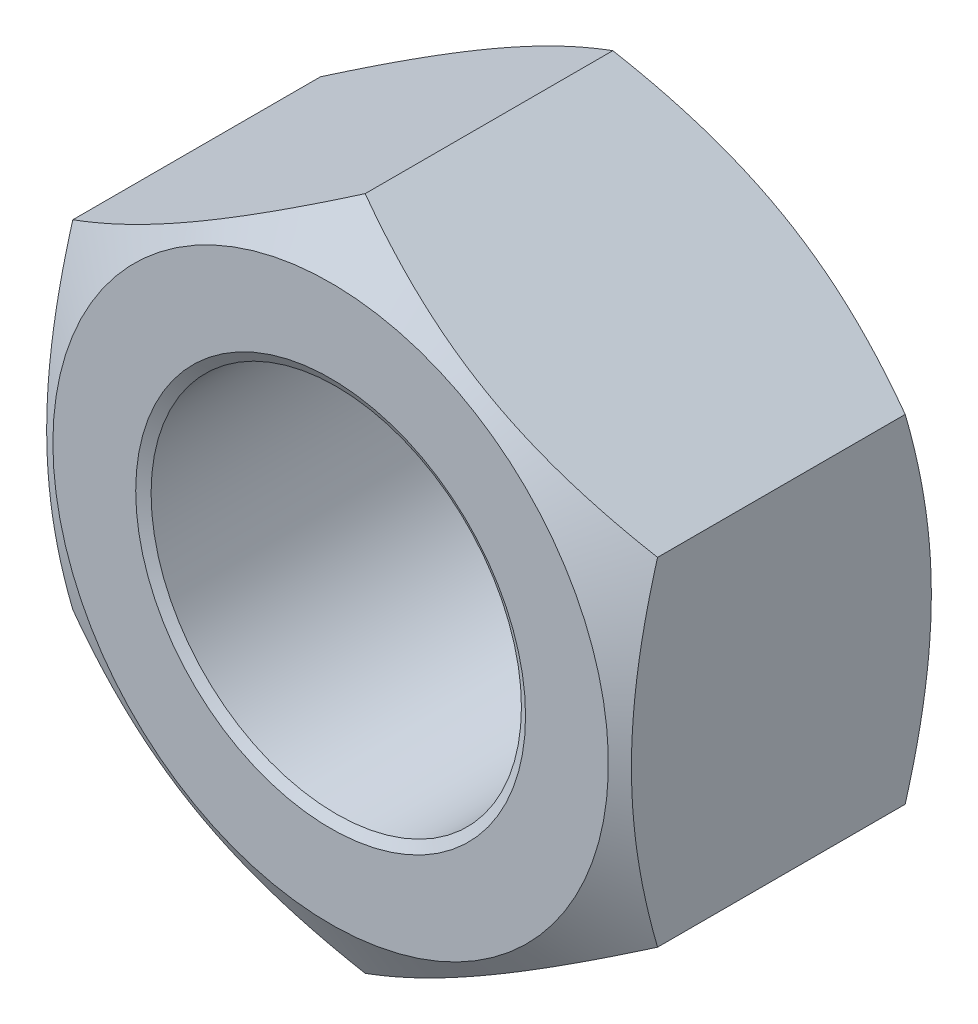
ISO-10303-21;
HEADER;
FILE_DESCRIPTION(('STEP AP214'),'2;1');
FILE_NAME('part.step','',(''),(''),'','','');
FILE_SCHEMA(('AUTOMOTIVE_DESIGN { 1 0 10303 214 1 1 1 1 }'));
ENDSEC;
DATA;
#1=APPLICATION_CONTEXT('core data for automotive mechanical design processes');
#2=APPLICATION_PROTOCOL_DEFINITION('international standard','automotive_design',2000,#1);
#3=PRODUCT_CONTEXT('',#1,'mechanical');
#4=PRODUCT('Part','Part','',(#3));
#5=PRODUCT_RELATED_PRODUCT_CATEGORY('part','',(#4));
#6=PRODUCT_DEFINITION_FORMATION('','',#4);
#7=PRODUCT_DEFINITION_CONTEXT('part definition',#1,'design');
#8=PRODUCT_DEFINITION('design','',#6,#7);
#9=PRODUCT_DEFINITION_SHAPE('','',#8);
#10=(LENGTH_UNIT() NAMED_UNIT(*) SI_UNIT(.MILLI.,.METRE.));
#11=(NAMED_UNIT(*) PLANE_ANGLE_UNIT() SI_UNIT($,.RADIAN.));
#12=(NAMED_UNIT(*) SI_UNIT($,.STERADIAN.) SOLID_ANGLE_UNIT());
#13=UNCERTAINTY_MEASURE_WITH_UNIT(LENGTH_MEASURE(1.E-05),#10,'distance_accuracy_value','');
#14=(GEOMETRIC_REPRESENTATION_CONTEXT(3) GLOBAL_UNCERTAINTY_ASSIGNED_CONTEXT((#13)) GLOBAL_UNIT_ASSIGNED_CONTEXT((#10,
#11,#12)) REPRESENTATION_CONTEXT('',''));
#15=CARTESIAN_POINT('',(0.,0.,0.));
#16=DIRECTION('',(0.,0.,1.));
#17=DIRECTION('',(1.,0.,0.));
#18=AXIS2_PLACEMENT_3D('',#15,#16,#17);
#19=CARTESIAN_POINT('',(0.,13.856406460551,13.));
#20=DIRECTION('',(-0.499999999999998,-0.86602540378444,0.));
#21=DIRECTION('',(0.86602540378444,-0.499999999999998,0.));
#22=AXIS2_PLACEMENT_3D('',#19,#20,#21);
#23=PLANE('',#22);
#24=DIRECTION('',(0.,0.,-1.));
#25=VECTOR('',#24,1.);
#26=CARTESIAN_POINT('',(12.,6.92820323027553,13.));
#27=LINE('',#26,#25);
#28=CARTESIAN_POINT('',(12.,6.92820323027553,11.5817930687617));
#29=VERTEX_POINT('',#28);
#30=CARTESIAN_POINT('',(12.,6.92820323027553,1.41820693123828));
#31=VERTEX_POINT('',#30);
#32=EDGE_CURVE('E232',#29,#31,#27,.T.);
#33=ORIENTED_EDGE('',*,*,#32,.T.);
#34=CARTESIAN_POINT('',(12.0002,6.9280877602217,1.41827359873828));
#35=CARTESIAN_POINT('',(11.7364142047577,7.08038456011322,1.33035979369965));
#36=CARTESIAN_POINT('',(11.4716448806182,7.23324920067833,1.24643615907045));
#37=CARTESIAN_POINT('',(10.9399829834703,7.54020434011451,1.08767638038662));
#38=CARTESIAN_POINT('',(10.6730897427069,7.69429522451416,1.01284322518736));
#39=CARTESIAN_POINT('',(9.86810959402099,8.15905073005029,0.803427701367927));
#40=CARTESIAN_POINT('',(9.32684492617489,8.47155003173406,0.684313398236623));
#41=CARTESIAN_POINT('',(8.51686717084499,8.93919090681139,0.544641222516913));
#42=CARTESIAN_POINT('',(8.25057389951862,9.09293539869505,0.504853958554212));
#43=CARTESIAN_POINT('',(7.71675440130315,9.40113622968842,0.438133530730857));
#44=CARTESIAN_POINT('',(7.44922815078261,9.55559258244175,0.411200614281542));
#45=CARTESIAN_POINT('',(6.91372963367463,9.86476279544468,0.370878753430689));
#46=CARTESIAN_POINT('',(6.64575827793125,10.0194761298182,0.357473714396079));
#47=CARTESIAN_POINT('',(6.10956726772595,10.3290461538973,0.344493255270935));
#48=CARTESIAN_POINT('',(5.84134762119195,10.4839028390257,0.344917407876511));
#49=CARTESIAN_POINT('',(5.33991062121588,10.7734076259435,0.358630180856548));
#50=CARTESIAN_POINT('',(5.10665750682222,10.908076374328,0.370246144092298));
#51=CARTESIAN_POINT('',(4.6406877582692,11.1771041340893,0.40371817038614));
#52=CARTESIAN_POINT('',(4.4079711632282,11.3114631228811,0.425574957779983));
#53=CARTESIAN_POINT('',(3.94320092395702,11.5797983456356,0.479147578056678));
#54=CARTESIAN_POINT('',(3.71114798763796,11.7137741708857,0.510871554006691));
#55=CARTESIAN_POINT('',(3.24813003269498,11.9810977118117,0.583621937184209));
#56=CARTESIAN_POINT('',(3.01716508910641,12.1144453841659,0.624648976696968));
#57=CARTESIAN_POINT('',(2.31605804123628,12.5192297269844,0.762721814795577));
#58=CARTESIAN_POINT('',(1.84794625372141,12.789494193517,0.8735350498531));
#59=CARTESIAN_POINT('',(0.918702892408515,13.3259930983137,1.12503592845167));
#60=CARTESIAN_POINT('',(0.457559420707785,13.5922344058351,1.26566450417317));
#61=CARTESIAN_POINT('',(-0.000200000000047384,13.8565219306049,1.41827359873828));
#62=B_SPLINE_CURVE_WITH_KNOTS('',3,(#34,#35,#36,#37,#38,#39,#40,#41,#42,#43,#44,#45,#46,#47,#48,
#49,#50,#51,#52,#53,#54,#55,#56,#57,#58,#59,#60,#61),.UNSPECIFIED.,.F.,.F.,(4,2,2,2,2,2,2,2,2,2,
2,2,2,4),(0.,0.951004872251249,1.90232158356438,3.80900466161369,4.73894551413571,
5.6689042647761,6.59775529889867,7.52657763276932,8.33514643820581,9.14377244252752,
9.95306755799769,10.7624176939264,12.4167102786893,14.0677556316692),.UNSPECIFIED.);
#63=CARTESIAN_POINT('',(0.,13.856406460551,1.41820693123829));
#64=VERTEX_POINT('',#63);
#65=EDGE_CURVE('E51',#31,#64,#62,.T.);
#66=ORIENTED_EDGE('',*,*,#65,.T.);
#67=DIRECTION('',(0.,0.,-1.));
#68=VECTOR('',#67,1.);
#69=CARTESIAN_POINT('',(0.,13.856406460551,13.));
#70=LINE('',#69,#68);
#71=CARTESIAN_POINT('',(0.,13.856406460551,11.5817930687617));
#72=VERTEX_POINT('',#71);
#73=EDGE_CURVE('E105',#72,#64,#70,.T.);
#74=ORIENTED_EDGE('',*,*,#73,.F.);
#75=CARTESIAN_POINT('',(-0.000200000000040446,13.8565219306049,11.5817264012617));
#76=CARTESIAN_POINT('',(0.263585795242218,13.7042251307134,11.6696402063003));
#77=CARTESIAN_POINT('',(0.528355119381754,13.5513604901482,11.7535638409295));
#78=CARTESIAN_POINT('',(1.06001701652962,13.244405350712,11.9123236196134));
#79=CARTESIAN_POINT('',(1.32691025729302,13.0903144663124,11.9871567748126));
#80=CARTESIAN_POINT('',(2.13189040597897,12.6255589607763,12.196572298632));
#81=CARTESIAN_POINT('',(2.67315507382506,12.3130596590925,12.3156866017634));
#82=CARTESIAN_POINT('',(3.48313282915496,11.8454187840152,12.4553587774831));
#83=CARTESIAN_POINT('',(3.74942610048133,11.6916742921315,12.4951460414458));
#84=CARTESIAN_POINT('',(4.2832455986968,11.3834734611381,12.5618664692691));
#85=CARTESIAN_POINT('',(4.55077184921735,11.2290171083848,12.5887993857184));
#86=CARTESIAN_POINT('',(5.08627036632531,10.9198468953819,12.6291212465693));
#87=CARTESIAN_POINT('',(5.35424172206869,10.7651335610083,12.6425262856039));
#88=CARTESIAN_POINT('',(5.89043273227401,10.4555635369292,12.655506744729));
#89=CARTESIAN_POINT('',(6.15865237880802,10.3007068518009,12.6550825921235));
#90=CARTESIAN_POINT('',(6.66008937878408,10.0112020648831,12.6413698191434));
#91=CARTESIAN_POINT('',(6.89334249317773,9.87653331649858,12.6297538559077));
#92=CARTESIAN_POINT('',(7.35931224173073,9.60750555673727,12.5962818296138));
#93=CARTESIAN_POINT('',(7.59202883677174,9.47314656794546,12.57442504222));
#94=CARTESIAN_POINT('',(8.05679907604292,9.20481134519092,12.5208524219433));
#95=CARTESIAN_POINT('',(8.28885201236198,9.07083551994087,12.4891284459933));
#96=CARTESIAN_POINT('',(8.75186996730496,8.80351197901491,12.4163780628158));
#97=CARTESIAN_POINT('',(8.98283491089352,8.67016430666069,12.375351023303));
#98=CARTESIAN_POINT('',(9.68394195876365,8.26537996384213,12.2372781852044));
#99=CARTESIAN_POINT('',(10.1520537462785,7.99511549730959,12.1264649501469));
#100=CARTESIAN_POINT('',(11.0812971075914,7.45861659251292,11.8749640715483));
#101=CARTESIAN_POINT('',(11.5424405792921,7.19237528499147,11.7343354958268));
#102=CARTESIAN_POINT('',(12.0002,6.92808776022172,11.5817264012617));
#103=B_SPLINE_CURVE_WITH_KNOTS('',3,(#75,#76,#77,#78,#79,#80,#81,#82,#83,#84,#85,#86,#87,#88,
#89,#90,#91,#92,#93,#94,#95,#96,#97,#98,#99,#100,#101,#102),.UNSPECIFIED.,.F.,.F.,(4,2,2,2,2,2,
2,2,2,2,2,2,2,4),(0.,0.951004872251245,1.90232158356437,3.80900466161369,4.73894551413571,
5.6689042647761,6.59775529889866,7.52657763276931,8.33514643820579,9.1437724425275,
9.95306755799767,10.7624176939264,12.4167102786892,14.0677556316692),.UNSPECIFIED.);
#104=EDGE_CURVE('E149',#72,#29,#103,.T.);
#105=ORIENTED_EDGE('',*,*,#104,.T.);
#106=EDGE_LOOP('',(#33,#66,#74,#105));
#107=FACE_BOUND('',#106,.T.);
#108=ADVANCED_FACE('F36',(#107),#23,.F.);
#109=CARTESIAN_POINT('',(-12.,6.92820323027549,13.));
#110=DIRECTION('',(0.500000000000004,-0.866025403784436,0.));
#111=DIRECTION('',(0.866025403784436,0.500000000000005,0.));
#112=AXIS2_PLACEMENT_3D('',#109,#110,#111);
#113=PLANE('',#112);
#114=ORIENTED_EDGE('',*,*,#73,.T.);
#115=CARTESIAN_POINT('',(0.000199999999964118,13.8565219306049,1.41827359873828));
#116=CARTESIAN_POINT('',(-0.263585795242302,13.7042251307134,1.33035979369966));
#117=CARTESIAN_POINT('',(-0.528355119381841,13.5513604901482,1.24643615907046));
#118=CARTESIAN_POINT('',(-1.0600170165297,13.2444053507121,1.08767638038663));
#119=CARTESIAN_POINT('',(-1.32691025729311,13.0903144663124,1.01284322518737));
#120=CARTESIAN_POINT('',(-2.13189040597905,12.6255589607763,0.803427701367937));
#121=CARTESIAN_POINT('',(-2.67315507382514,12.3130596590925,0.684313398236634));
#122=CARTESIAN_POINT('',(-3.48313282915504,11.8454187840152,0.544641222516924));
#123=CARTESIAN_POINT('',(-3.74942610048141,11.6916742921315,0.504853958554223));
#124=CARTESIAN_POINT('',(-4.28324559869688,11.3834734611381,0.438133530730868));
#125=CARTESIAN_POINT('',(-4.55077184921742,11.2290171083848,0.411200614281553));
#126=CARTESIAN_POINT('',(-5.08627036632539,10.9198468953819,0.370878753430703));
#127=CARTESIAN_POINT('',(-5.35424172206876,10.7651335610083,0.357473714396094));
#128=CARTESIAN_POINT('',(-5.89043273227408,10.4555635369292,0.344493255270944));
#129=CARTESIAN_POINT('',(-6.15865237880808,10.3007068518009,0.344917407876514));
#130=CARTESIAN_POINT('',(-6.66008937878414,10.011202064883,0.358630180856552));
#131=CARTESIAN_POINT('',(-6.89334249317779,9.87653331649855,0.370246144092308));
#132=CARTESIAN_POINT('',(-7.3593122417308,9.60750555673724,0.403718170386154));
#133=CARTESIAN_POINT('',(-7.5920288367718,9.47314656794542,0.425574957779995));
#134=CARTESIAN_POINT('',(-8.05679907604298,9.20481134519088,0.479147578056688));
#135=CARTESIAN_POINT('',(-8.28885201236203,9.07083551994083,0.510871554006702));
#136=CARTESIAN_POINT('',(-8.75186996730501,8.80351197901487,0.583621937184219));
#137=CARTESIAN_POINT('',(-8.98283491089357,8.67016430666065,0.624648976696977));
#138=CARTESIAN_POINT('',(-9.68394195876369,8.26537996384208,0.762721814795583));
#139=CARTESIAN_POINT('',(-10.1520537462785,7.99511549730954,0.873535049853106));
#140=CARTESIAN_POINT('',(-11.0812971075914,7.45861659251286,1.12503592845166));
#141=CARTESIAN_POINT('',(-11.5424405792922,7.1923752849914,1.26566450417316));
#142=CARTESIAN_POINT('',(-12.0002,6.92808776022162,1.41827359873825));
#143=B_SPLINE_CURVE_WITH_KNOTS('',3,(#115,#116,#117,#118,#119,#120,#121,#122,#123,#124,#125,
#126,#127,#128,#129,#130,#131,#132,#133,#134,#135,#136,#137,#138,#139,#140,#141,#142),
.UNSPECIFIED.,.F.,.F.,(4,2,2,2,2,2,2,2,2,2,2,2,2,4),(0.,0.95100487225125,1.90232158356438,
3.8090046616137,4.73894551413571,5.66890426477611,6.59775529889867,7.52657763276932,
8.3351464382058,9.14377244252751,9.95306755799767,10.7624176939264,12.4167102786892,
14.0677556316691),.UNSPECIFIED.);
#144=CARTESIAN_POINT('',(-12.,6.92820323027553,1.41820693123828));
#145=VERTEX_POINT('',#144);
#146=EDGE_CURVE('E90',#64,#145,#143,.T.);
#147=ORIENTED_EDGE('',*,*,#146,.T.);
#148=DIRECTION('',(0.,0.,-1.));
#149=VECTOR('',#148,1.);
#150=CARTESIAN_POINT('',(-12.,6.92820323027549,13.));
#151=LINE('',#150,#149);
#152=CARTESIAN_POINT('',(-12.,6.92820323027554,11.5817930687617));
#153=VERTEX_POINT('',#152);
#154=EDGE_CURVE('E103',#153,#145,#151,.T.);
#155=ORIENTED_EDGE('',*,*,#154,.F.);
#156=CARTESIAN_POINT('',(-12.0002,6.92808776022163,11.5817264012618));
#157=CARTESIAN_POINT('',(-11.7364142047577,7.08038456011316,11.6696402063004));
#158=CARTESIAN_POINT('',(-11.4716448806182,7.23324920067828,11.7535638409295));
#159=CARTESIAN_POINT('',(-10.9399829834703,7.54020434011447,11.9123236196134));
#160=CARTESIAN_POINT('',(-10.6730897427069,7.69429522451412,11.9871567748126));
#161=CARTESIAN_POINT('',(-9.868109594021,8.15905073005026,12.1965722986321));
#162=CARTESIAN_POINT('',(-9.32684492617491,8.47155003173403,12.3156866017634));
#163=CARTESIAN_POINT('',(-8.51686717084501,8.93919090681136,12.4553587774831));
#164=CARTESIAN_POINT('',(-8.25057389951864,9.09293539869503,12.4951460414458));
#165=CARTESIAN_POINT('',(-7.71675440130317,9.40113622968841,12.5618664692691));
#166=CARTESIAN_POINT('',(-7.44922815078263,9.55559258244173,12.5887993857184));
#167=CARTESIAN_POINT('',(-6.91372963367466,9.86476279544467,12.6291212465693));
#168=CARTESIAN_POINT('',(-6.64575827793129,10.0194761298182,12.6425262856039));
#169=CARTESIAN_POINT('',(-6.10956726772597,10.3290461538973,12.655506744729));
#170=CARTESIAN_POINT('',(-5.84134762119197,10.4839028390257,12.6550825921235));
#171=CARTESIAN_POINT('',(-5.33991062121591,10.7734076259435,12.6413698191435));
#172=CARTESIAN_POINT('',(-5.10665750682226,10.908076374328,12.6297538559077));
#173=CARTESIAN_POINT('',(-4.64068775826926,11.1771041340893,12.5962818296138));
#174=CARTESIAN_POINT('',(-4.40797116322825,11.3114631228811,12.57442504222));
#175=CARTESIAN_POINT('',(-3.94320092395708,11.5797983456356,12.5208524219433));
#176=CARTESIAN_POINT('',(-3.71114798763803,11.7137741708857,12.4891284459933));
#177=CARTESIAN_POINT('',(-3.24813003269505,11.9810977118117,12.4163780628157));
#178=CARTESIAN_POINT('',(-3.01716508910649,12.1144453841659,12.375351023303));
#179=CARTESIAN_POINT('',(-2.31605804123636,12.5192297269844,12.2372781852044));
#180=CARTESIAN_POINT('',(-1.8479462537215,12.789494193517,12.1264649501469));
#181=CARTESIAN_POINT('',(-0.918702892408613,13.3259930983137,11.8749640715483));
#182=CARTESIAN_POINT('',(-0.457559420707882,13.5922344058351,11.7343354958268));
#183=CARTESIAN_POINT('',(0.000199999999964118,13.8565219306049,11.5817264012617));
#184=B_SPLINE_CURVE_WITH_KNOTS('',3,(#156,#157,#158,#159,#160,#161,#162,#163,#164,#165,#166,
#167,#168,#169,#170,#171,#172,#173,#174,#175,#176,#177,#178,#179,#180,#181,#182,#183),
.UNSPECIFIED.,.F.,.F.,(4,2,2,2,2,2,2,2,2,2,2,2,2,4),(0.,0.951004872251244,1.90232158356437,
3.80900466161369,4.7389455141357,5.6689042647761,6.59775529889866,7.52657763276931,
8.33514643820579,9.14377244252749,9.95306755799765,10.7624176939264,12.4167102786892,
14.0677556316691),.UNSPECIFIED.);
#185=EDGE_CURVE('E220',#153,#72,#184,.T.);
#186=ORIENTED_EDGE('',*,*,#185,.T.);
#187=EDGE_LOOP('',(#114,#147,#155,#186));
#188=FACE_BOUND('',#187,.T.);
#189=ADVANCED_FACE('F101',(#188),#113,.F.);
#190=CARTESIAN_POINT('',(-12.,6.92820323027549,13.));
#191=DIRECTION('',(1.,0.,0.));
#192=DIRECTION('',(0.,1.,0.));
#193=AXIS2_PLACEMENT_3D('',#190,#191,#192);
#194=PLANE('',#193);
#195=ORIENTED_EDGE('',*,*,#154,.T.);
#196=CARTESIAN_POINT('',(-12.,-18.3266119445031,6.06553478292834));
#197=CARTESIAN_POINT('',(-12.,-18.0633738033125,5.93838905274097));
#198=CARTESIAN_POINT('',(-12.,-17.7998161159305,5.81190522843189));
#199=CARTESIAN_POINT('',(-12.,-17.2719941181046,5.56041343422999));
#200=CARTESIAN_POINT('',(-12.,-17.0077297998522,5.43540548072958));
#201=CARTESIAN_POINT('',(-12.,-16.2136974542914,5.06278691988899));
#202=CARTESIAN_POINT('',(-12.,-15.6827764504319,4.81762347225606));
#203=CARTESIAN_POINT('',(-12.,-14.6141865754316,4.33400167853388));
#204=CARTESIAN_POINT('',(-12.,-14.0764964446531,4.09559018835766));
#205=CARTESIAN_POINT('',(-12.,-12.9966796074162,3.62907285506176));
#206=CARTESIAN_POINT('',(-12.,-12.4545531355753,3.40096647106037));
#207=CARTESIAN_POINT('',(-12.,-11.3584956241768,2.95519182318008));
#208=CARTESIAN_POINT('',(-12.,-10.804500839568,2.73767946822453));
#209=CARTESIAN_POINT('',(-12.,-9.68995596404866,2.31980973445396));
#210=CARTESIAN_POINT('',(-12.,-9.12940515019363,2.11945426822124));
#211=CARTESIAN_POINT('',(-12.,-8.00204242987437,1.74131954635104));
#212=CARTESIAN_POINT('',(-12.,-7.4352468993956,1.56349187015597));
#213=CARTESIAN_POINT('',(-12.,-6.29354549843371,1.23621050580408));
#214=CARTESIAN_POINT('',(-12.,-5.71864226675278,1.08674780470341));
#215=CARTESIAN_POINT('',(-12.,-4.85009397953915,0.889319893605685));
#216=CARTESIAN_POINT('',(-12.,-4.55947337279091,0.827959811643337));
#217=CARTESIAN_POINT('',(-12.,-3.97630768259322,0.715136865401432));
#218=CARTESIAN_POINT('',(-12.,-3.68376264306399,0.663673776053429));
#219=CARTESIAN_POINT('',(-12.,-3.09694252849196,0.571559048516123));
#220=CARTESIAN_POINT('',(-12.,-2.80266731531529,0.530908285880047));
#221=CARTESIAN_POINT('',(-12.,-2.21274417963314,0.461238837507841));
#222=CARTESIAN_POINT('',(-12.,-1.91709630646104,0.4322197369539));
#223=CARTESIAN_POINT('',(-12.,-1.32669155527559,0.386589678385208));
#224=CARTESIAN_POINT('',(-12.,-1.03194060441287,0.369902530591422));
#225=CARTESIAN_POINT('',(-12.,-0.441998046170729,0.349024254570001));
#226=CARTESIAN_POINT('',(-12.,-0.146806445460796,0.344832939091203));
#227=CARTESIAN_POINT('',(-12.,0.443406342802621,0.34904547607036));
#228=CARTESIAN_POINT('',(-12.,0.738427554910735,0.357445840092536));
#229=CARTESIAN_POINT('',(-12.,1.32786031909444,0.386634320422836));
#230=CARTESIAN_POINT('',(-12.,1.62227183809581,0.407423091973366));
#231=CARTESIAN_POINT('',(-12.,2.33716550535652,0.472512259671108));
#232=CARTESIAN_POINT('',(-12.,2.7570868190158,0.523093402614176));
#233=CARTESIAN_POINT('',(-12.,3.59360745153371,0.646630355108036));
#234=CARTESIAN_POINT('',(-12.,4.01020626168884,0.719589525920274));
#235=CARTESIAN_POINT('',(-12.,5.25576165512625,0.968370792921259));
#236=CARTESIAN_POINT('',(-12.,6.07884579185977,1.17392928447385));
#237=CARTESIAN_POINT('',(-12.,7.30994810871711,1.52797009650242));
#238=CARTESIAN_POINT('',(-12.,7.72440857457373,1.65531708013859));
#239=CARTESIAN_POINT('',(-12.,8.54932524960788,1.92260619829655));
#240=CARTESIAN_POINT('',(-12.,8.95978109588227,2.06254946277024));
#241=CARTESIAN_POINT('',(-12.,9.77464090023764,2.35205699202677));
#242=CARTESIAN_POINT('',(-12.,10.1790659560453,2.50156237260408));
#243=CARTESIAN_POINT('',(-12.,10.7831621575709,2.7322434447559));
#244=CARTESIAN_POINT('',(-12.,10.9840717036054,2.81019450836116));
#245=CARTESIAN_POINT('',(-12.,11.3851122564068,2.96806360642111));
#246=CARTESIAN_POINT('',(-12.,11.5852432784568,3.04798160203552));
#247=CARTESIAN_POINT('',(-12.,11.7850121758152,3.12879414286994));
#248=B_SPLINE_CURVE_WITH_KNOTS('',3,(#196,#197,#198,#199,#200,#201,#202,#203,#204,#205,#206,
#207,#208,#209,#210,#211,#212,#213,#214,#215,#216,#217,#218,#219,#220,#221,#222,#223,#224,#225,
#226,#227,#228,#229,#230,#231,#232,#233,#234,#235,#236,#237,#238,#239,#240,#241,#242,#243,#244,
#245,#246,#247),.UNSPECIFIED.,.F.,.F.,(4,2,2,2,2,2,2,2,2,2,2,2,2,2,2,2,2,2,2,2,2,2,2,2,2,4),(0.,
0.877006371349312,1.75402247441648,3.50834272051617,5.2727863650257,7.03713729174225,
8.8224164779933,10.6078944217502,12.3894671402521,14.1704728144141,15.0614141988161,
15.9523353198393,16.8433285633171,17.7342900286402,18.6196998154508,19.5050963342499,
20.3902476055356,21.2754456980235,22.5435942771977,23.8119334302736,26.3535098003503,
27.6541599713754,28.9549269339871,30.248337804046,30.8948341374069,31.5413177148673),.UNSPECIFIED.);
#249=CARTESIAN_POINT('',(-12.,-6.92820323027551,1.41820693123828));
#250=VERTEX_POINT('',#249);
#251=EDGE_CURVE('E87',#145,#250,#248,.F.);
#252=ORIENTED_EDGE('',*,*,#251,.T.);
#253=DIRECTION('',(0.,0.,-1.));
#254=VECTOR('',#253,1.);
#255=CARTESIAN_POINT('',(-12.,-6.92820323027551,13.));
#256=LINE('',#255,#254);
#257=CARTESIAN_POINT('',(-12.,-6.92820323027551,11.5817930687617));
#258=VERTEX_POINT('',#257);
#259=EDGE_CURVE('E110',#258,#250,#256,.T.);
#260=ORIENTED_EDGE('',*,*,#259,.F.);
#261=CARTESIAN_POINT('',(-12.,-18.3266119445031,6.93446521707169));
#262=CARTESIAN_POINT('',(-12.,-18.0633738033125,7.06161094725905));
#263=CARTESIAN_POINT('',(-12.,-17.7998161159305,7.18809477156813));
#264=CARTESIAN_POINT('',(-12.,-17.2719941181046,7.43958656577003));
#265=CARTESIAN_POINT('',(-12.,-17.0077297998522,7.56459451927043));
#266=CARTESIAN_POINT('',(-12.,-16.2136974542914,7.93721308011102));
#267=CARTESIAN_POINT('',(-12.,-15.6827764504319,8.18237652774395));
#268=CARTESIAN_POINT('',(-12.,-14.6141865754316,8.66599832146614));
#269=CARTESIAN_POINT('',(-12.,-14.0764964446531,8.90440981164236));
#270=CARTESIAN_POINT('',(-12.,-12.9966796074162,9.37092714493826));
#271=CARTESIAN_POINT('',(-12.,-12.4545531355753,9.59903352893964));
#272=CARTESIAN_POINT('',(-12.,-11.3584956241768,10.0448081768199));
#273=CARTESIAN_POINT('',(-12.,-10.804500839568,10.2623205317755));
#274=CARTESIAN_POINT('',(-12.,-9.68995596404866,10.6801902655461));
#275=CARTESIAN_POINT('',(-12.,-9.12940515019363,10.8805457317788));
#276=CARTESIAN_POINT('',(-12.,-8.00204242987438,11.258680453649));
#277=CARTESIAN_POINT('',(-12.,-7.4352468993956,11.436508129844));
#278=CARTESIAN_POINT('',(-12.,-6.29354549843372,11.7637894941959));
#279=CARTESIAN_POINT('',(-12.,-5.71864226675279,11.9132521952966));
#280=CARTESIAN_POINT('',(-12.,-4.85009397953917,12.1106801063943));
#281=CARTESIAN_POINT('',(-12.,-4.55947337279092,12.1720401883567));
#282=CARTESIAN_POINT('',(-12.,-3.97630768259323,12.2848631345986));
#283=CARTESIAN_POINT('',(-12.,-3.68376264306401,12.3363262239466));
#284=CARTESIAN_POINT('',(-12.,-3.09694252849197,12.4284409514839));
#285=CARTESIAN_POINT('',(-12.,-2.8026673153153,12.46909171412));
#286=CARTESIAN_POINT('',(-12.,-2.21274417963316,12.5387611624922));
#287=CARTESIAN_POINT('',(-12.,-1.91709630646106,12.5677802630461));
#288=CARTESIAN_POINT('',(-12.,-1.32669155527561,12.6134103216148));
#289=CARTESIAN_POINT('',(-12.,-1.0319406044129,12.6300974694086));
#290=CARTESIAN_POINT('',(-12.,-0.441998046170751,12.65097574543));
#291=CARTESIAN_POINT('',(-12.,-0.146806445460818,12.6551670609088));
#292=CARTESIAN_POINT('',(-12.,0.443406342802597,12.6509545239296));
#293=CARTESIAN_POINT('',(-12.,0.738427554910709,12.6425541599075));
#294=CARTESIAN_POINT('',(-12.,1.32786031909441,12.6133656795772));
#295=CARTESIAN_POINT('',(-12.,1.62227183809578,12.5925769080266));
#296=CARTESIAN_POINT('',(-12.,2.33716550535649,12.5274877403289));
#297=CARTESIAN_POINT('',(-12.,2.75708681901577,12.4769065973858));
#298=CARTESIAN_POINT('',(-12.,3.59360745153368,12.353369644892));
#299=CARTESIAN_POINT('',(-12.,4.01020626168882,12.2804104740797));
#300=CARTESIAN_POINT('',(-12.,5.25576165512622,12.0316292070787));
#301=CARTESIAN_POINT('',(-12.,6.07884579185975,11.8260707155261));
#302=CARTESIAN_POINT('',(-12.,7.30994810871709,11.4720299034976));
#303=CARTESIAN_POINT('',(-12.,7.72440857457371,11.3446829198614));
#304=CARTESIAN_POINT('',(-12.,8.54932524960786,11.0773938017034));
#305=CARTESIAN_POINT('',(-12.,8.95978109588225,10.9374505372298));
#306=CARTESIAN_POINT('',(-12.,9.77464090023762,10.6479430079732));
#307=CARTESIAN_POINT('',(-12.,10.1790659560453,10.4984376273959));
#308=CARTESIAN_POINT('',(-12.,10.7831621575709,10.2677565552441));
#309=CARTESIAN_POINT('',(-12.,10.9840717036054,10.1898054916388));
#310=CARTESIAN_POINT('',(-12.,11.3851122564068,10.0319363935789));
#311=CARTESIAN_POINT('',(-12.,11.5852432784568,9.95201839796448));
#312=CARTESIAN_POINT('',(-12.,11.7850121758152,9.87120585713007));
#313=B_SPLINE_CURVE_WITH_KNOTS('',3,(#261,#262,#263,#264,#265,#266,#267,#268,#269,#270,#271,
#272,#273,#274,#275,#276,#277,#278,#279,#280,#281,#282,#283,#284,#285,#286,#287,#288,#289,#290,
#291,#292,#293,#294,#295,#296,#297,#298,#299,#300,#301,#302,#303,#304,#305,#306,#307,#308,#309,
#310,#311,#312),.UNSPECIFIED.,.F.,.F.,(4,2,2,2,2,2,2,2,2,2,2,2,2,2,2,2,2,2,2,2,2,2,2,2,2,4),(0.,
0.877006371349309,1.75402247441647,3.50834272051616,5.27278636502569,7.03713729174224,
8.8224164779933,10.6078944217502,12.3894671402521,14.1704728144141,15.061414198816,
15.9523353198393,16.8433285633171,17.7342900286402,18.6196998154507,19.5050963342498,
20.3902476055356,21.2754456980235,22.5435942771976,23.8119334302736,26.3535098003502,
27.6541599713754,28.954926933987,30.248337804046,30.8948341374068,31.5413177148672),.UNSPECIFIED.);
#314=EDGE_CURVE('E109',#258,#153,#313,.T.);
#315=ORIENTED_EDGE('',*,*,#314,.T.);
#316=EDGE_LOOP('',(#195,#252,#260,#315));
#317=FACE_BOUND('',#316,.T.);
#318=ADVANCED_FACE('F108',(#317),#194,.F.);
#319=CARTESIAN_POINT('',(-12.,-6.92820323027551,13.));
#320=DIRECTION('',(0.499999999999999,0.866025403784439,0.));
#321=DIRECTION('',(-0.86602540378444,0.499999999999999,0.));
#322=AXIS2_PLACEMENT_3D('',#319,#320,#321);
#323=PLANE('',#322);
#324=ORIENTED_EDGE('',*,*,#259,.T.);
#325=CARTESIAN_POINT('',(-12.0002,-6.92808776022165,1.41827359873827));
#326=CARTESIAN_POINT('',(-11.7364142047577,-7.08038456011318,1.33035979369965));
#327=CARTESIAN_POINT('',(-11.4716448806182,-7.2332492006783,1.24643615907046));
#328=CARTESIAN_POINT('',(-10.9399829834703,-7.54020434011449,1.08767638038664));
#329=CARTESIAN_POINT('',(-10.6730897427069,-7.69429522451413,1.01284322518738));
#330=CARTESIAN_POINT('',(-9.86810959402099,-8.15905073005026,0.803427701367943));
#331=CARTESIAN_POINT('',(-9.32684492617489,-8.47155003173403,0.68431339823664));
#332=CARTESIAN_POINT('',(-8.51686717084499,-8.93919090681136,0.544641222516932));
#333=CARTESIAN_POINT('',(-8.25057389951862,-9.09293539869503,0.504853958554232));
#334=CARTESIAN_POINT('',(-7.71675440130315,-9.4011362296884,0.438133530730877));
#335=CARTESIAN_POINT('',(-7.44922815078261,-9.55559258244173,0.411200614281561));
#336=CARTESIAN_POINT('',(-6.91372963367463,-9.86476279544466,0.370878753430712));
#337=CARTESIAN_POINT('',(-6.64575827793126,-10.0194761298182,0.357473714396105));
#338=CARTESIAN_POINT('',(-6.10956726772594,-10.3290461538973,0.344493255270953));
#339=CARTESIAN_POINT('',(-5.84134762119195,-10.4839028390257,0.34491740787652));
#340=CARTESIAN_POINT('',(-5.33991062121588,-10.7734076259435,0.358630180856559));
#341=CARTESIAN_POINT('',(-5.10665750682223,-10.908076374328,0.370246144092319));
#342=CARTESIAN_POINT('',(-4.64068775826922,-11.1771041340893,0.403718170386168));
#343=CARTESIAN_POINT('',(-4.40797116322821,-11.3114631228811,0.425574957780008));
#344=CARTESIAN_POINT('',(-3.94320092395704,-11.5797983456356,0.4791475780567));
#345=CARTESIAN_POINT('',(-3.71114798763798,-11.7137741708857,0.510871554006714));
#346=CARTESIAN_POINT('',(-3.24813003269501,-11.9810977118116,0.58362193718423));
#347=CARTESIAN_POINT('',(-3.01716508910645,-12.1144453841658,0.624648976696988));
#348=CARTESIAN_POINT('',(-2.31605804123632,-12.5192297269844,0.762721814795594));
#349=CARTESIAN_POINT('',(-1.84794625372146,-12.7894941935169,0.873535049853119));
#350=CARTESIAN_POINT('',(-0.918702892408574,-13.3259930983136,1.12503592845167));
#351=CARTESIAN_POINT('',(-0.457559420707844,-13.5922344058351,1.26566450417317));
#352=CARTESIAN_POINT('',(0.000199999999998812,-13.8565219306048,1.41827359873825));
#353=B_SPLINE_CURVE_WITH_KNOTS('',3,(#325,#326,#327,#328,#329,#330,#331,#332,#333,#334,#335,
#336,#337,#338,#339,#340,#341,#342,#343,#344,#345,#346,#347,#348,#349,#350,#351,#352),
.UNSPECIFIED.,.F.,.F.,(4,2,2,2,2,2,2,2,2,2,2,2,2,4),(0.,0.951004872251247,1.90232158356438,
3.8090046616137,4.73894551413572,5.66890426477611,6.59775529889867,7.52657763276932,
8.3351464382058,9.14377244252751,9.95306755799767,10.7624176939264,12.4167102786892,
14.0677556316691),.UNSPECIFIED.);
#354=CARTESIAN_POINT('',(0.,-13.856406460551,1.41820693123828));
#355=VERTEX_POINT('',#354);
#356=EDGE_CURVE('E92',#250,#355,#353,.T.);
#357=ORIENTED_EDGE('',*,*,#356,.T.);
#358=DIRECTION('',(0.,0.,-1.));
#359=VECTOR('',#358,1.);
#360=CARTESIAN_POINT('',(0.,-13.856406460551,13.));
#361=LINE('',#360,#359);
#362=CARTESIAN_POINT('',(0.,-13.856406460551,11.5817930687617));
#363=VERTEX_POINT('',#362);
#364=EDGE_CURVE('E114',#363,#355,#361,.T.);
#365=ORIENTED_EDGE('',*,*,#364,.F.);
#366=CARTESIAN_POINT('',(0.000199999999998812,-13.8565219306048,11.5817264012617));
#367=CARTESIAN_POINT('',(-0.263585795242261,-13.7042251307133,11.6696402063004));
#368=CARTESIAN_POINT('',(-0.528355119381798,-13.5513604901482,11.7535638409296));
#369=CARTESIAN_POINT('',(-1.06001701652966,-13.244405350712,11.9123236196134));
#370=CARTESIAN_POINT('',(-1.32691025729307,-13.0903144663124,11.9871567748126));
#371=CARTESIAN_POINT('',(-2.13189040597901,-12.6255589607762,12.1965722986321));
#372=CARTESIAN_POINT('',(-2.67315507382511,-12.3130596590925,12.3156866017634));
#373=CARTESIAN_POINT('',(-3.483132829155,-11.8454187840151,12.4553587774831));
#374=CARTESIAN_POINT('',(-3.74942610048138,-11.6916742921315,12.4951460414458));
#375=CARTESIAN_POINT('',(-4.28324559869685,-11.3834734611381,12.5618664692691));
#376=CARTESIAN_POINT('',(-4.55077184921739,-11.2290171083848,12.5887993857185));
#377=CARTESIAN_POINT('',(-5.08627036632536,-10.9198468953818,12.6291212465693));
#378=CARTESIAN_POINT('',(-5.35424172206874,-10.7651335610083,12.6425262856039));
#379=CARTESIAN_POINT('',(-5.89043273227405,-10.4555635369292,12.6555067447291));
#380=CARTESIAN_POINT('',(-6.15865237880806,-10.3007068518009,12.6550825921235));
#381=CARTESIAN_POINT('',(-6.66008937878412,-10.011202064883,12.6413698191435));
#382=CARTESIAN_POINT('',(-6.89334249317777,-9.87653331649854,12.6297538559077));
#383=CARTESIAN_POINT('',(-7.35931224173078,-9.60750555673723,12.5962818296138));
#384=CARTESIAN_POINT('',(-7.59202883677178,-9.47314656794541,12.57442504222));
#385=CARTESIAN_POINT('',(-8.05679907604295,-9.20481134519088,12.5208524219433));
#386=CARTESIAN_POINT('',(-8.28885201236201,-9.07083551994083,12.4891284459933));
#387=CARTESIAN_POINT('',(-8.75186996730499,-8.80351197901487,12.4163780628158));
#388=CARTESIAN_POINT('',(-8.98283491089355,-8.67016430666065,12.375351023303));
#389=CARTESIAN_POINT('',(-9.68394195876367,-8.26537996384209,12.2372781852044));
#390=CARTESIAN_POINT('',(-10.1520537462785,-7.99511549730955,12.1264649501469));
#391=CARTESIAN_POINT('',(-11.0812971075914,-7.45861659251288,11.8749640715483));
#392=CARTESIAN_POINT('',(-11.5424405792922,-7.19237528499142,11.7343354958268));
#393=CARTESIAN_POINT('',(-12.0002,-6.92808776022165,11.5817264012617));
#394=B_SPLINE_CURVE_WITH_KNOTS('',3,(#366,#367,#368,#369,#370,#371,#372,#373,#374,#375,#376,
#377,#378,#379,#380,#381,#382,#383,#384,#385,#386,#387,#388,#389,#390,#391,#392,#393),
.UNSPECIFIED.,.F.,.F.,(4,2,2,2,2,2,2,2,2,2,2,2,2,4),(0.,0.951004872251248,1.90232158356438,
3.8090046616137,4.73894551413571,5.66890426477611,6.59775529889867,7.52657763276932,
8.3351464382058,9.1437724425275,9.95306755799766,10.7624176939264,12.4167102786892,
14.0677556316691),.UNSPECIFIED.);
#395=EDGE_CURVE('E221',#363,#258,#394,.T.);
#396=ORIENTED_EDGE('',*,*,#395,.T.);
#397=EDGE_LOOP('',(#324,#357,#365,#396));
#398=FACE_BOUND('',#397,.T.);
#399=ADVANCED_FACE('F211',(#398),#323,.F.);
#400=CARTESIAN_POINT('',(12.,-6.92820323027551,13.));
#401=DIRECTION('',(-0.499999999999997,0.866025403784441,0.));
#402=DIRECTION('',(-0.866025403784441,-0.499999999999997,0.));
#403=AXIS2_PLACEMENT_3D('',#400,#401,#402);
#404=PLANE('',#403);
#405=ORIENTED_EDGE('',*,*,#364,.T.);
#406=CARTESIAN_POINT('',(-0.000199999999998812,-13.8565219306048,1.41827359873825));
#407=CARTESIAN_POINT('',(0.263585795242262,-13.7042251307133,1.33035979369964));
#408=CARTESIAN_POINT('',(0.5283551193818,-13.5513604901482,1.24643615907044));
#409=CARTESIAN_POINT('',(1.06001701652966,-13.244405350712,1.08767638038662));
#410=CARTESIAN_POINT('',(1.32691025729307,-13.0903144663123,1.01284322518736));
#411=CARTESIAN_POINT('',(2.13189040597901,-12.6255589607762,0.803427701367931));
#412=CARTESIAN_POINT('',(2.6731550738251,-12.3130596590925,0.684313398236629));
#413=CARTESIAN_POINT('',(3.483132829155,-11.8454187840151,0.544641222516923));
#414=CARTESIAN_POINT('',(3.74942610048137,-11.6916742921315,0.504853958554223));
#415=CARTESIAN_POINT('',(4.28324559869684,-11.3834734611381,0.43813353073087));
#416=CARTESIAN_POINT('',(4.55077184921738,-11.2290171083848,0.411200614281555));
#417=CARTESIAN_POINT('',(5.08627036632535,-10.9198468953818,0.370878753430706));
#418=CARTESIAN_POINT('',(5.35424172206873,-10.7651335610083,0.357473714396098));
#419=CARTESIAN_POINT('',(5.89043273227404,-10.4555635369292,0.34449325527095));
#420=CARTESIAN_POINT('',(6.15865237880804,-10.3007068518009,0.34491740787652));
#421=CARTESIAN_POINT('',(6.66008937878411,-10.011202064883,0.358630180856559));
#422=CARTESIAN_POINT('',(6.89334249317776,-9.87653331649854,0.370246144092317));
#423=CARTESIAN_POINT('',(7.35931224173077,-9.60750555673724,0.403718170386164));
#424=CARTESIAN_POINT('',(7.59202883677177,-9.47314656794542,0.425574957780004));
#425=CARTESIAN_POINT('',(8.05679907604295,-9.20481134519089,0.479147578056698));
#426=CARTESIAN_POINT('',(8.28885201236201,-9.07083551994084,0.510871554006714));
#427=CARTESIAN_POINT('',(8.75186996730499,-8.80351197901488,0.583621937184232));
#428=CARTESIAN_POINT('',(8.98283491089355,-8.67016430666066,0.62464897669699));
#429=CARTESIAN_POINT('',(9.68394195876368,-8.2653799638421,0.762721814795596));
#430=CARTESIAN_POINT('',(10.1520537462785,-7.99511549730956,0.87353504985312));
#431=CARTESIAN_POINT('',(11.0812971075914,-7.45861659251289,1.12503592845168));
#432=CARTESIAN_POINT('',(11.5424405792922,-7.19237528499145,1.26566450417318));
#433=CARTESIAN_POINT('',(12.0002,-6.9280877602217,1.41827359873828));
#434=B_SPLINE_CURVE_WITH_KNOTS('',3,(#406,#407,#408,#409,#410,#411,#412,#413,#414,#415,#416,
#417,#418,#419,#420,#421,#422,#423,#424,#425,#426,#427,#428,#429,#430,#431,#432,#433),
.UNSPECIFIED.,.F.,.F.,(4,2,2,2,2,2,2,2,2,2,2,2,2,4),(0.,0.951004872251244,1.90232158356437,
3.80900466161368,4.73894551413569,5.66890426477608,6.59775529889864,7.52657763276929,
8.33514643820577,9.14377244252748,9.95306755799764,10.7624176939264,12.4167102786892,
14.0677556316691),.UNSPECIFIED.);
#435=CARTESIAN_POINT('',(12.,-6.92820323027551,1.41820693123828));
#436=VERTEX_POINT('',#435);
#437=EDGE_CURVE('E192',#355,#436,#434,.T.);
#438=ORIENTED_EDGE('',*,*,#437,.T.);
#439=DIRECTION('',(0.,0.,-1.));
#440=VECTOR('',#439,1.);
#441=CARTESIAN_POINT('',(12.,-6.92820323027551,13.));
#442=LINE('',#441,#440);
#443=CARTESIAN_POINT('',(12.,-6.92820323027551,11.5817930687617));
#444=VERTEX_POINT('',#443);
#445=EDGE_CURVE('E234',#444,#436,#442,.T.);
#446=ORIENTED_EDGE('',*,*,#445,.F.);
#447=CARTESIAN_POINT('',(12.0002,-6.9280877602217,11.5817264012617));
#448=CARTESIAN_POINT('',(11.7364142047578,-7.08038456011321,11.6696402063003));
#449=CARTESIAN_POINT('',(11.4716448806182,-7.23324920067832,11.7535638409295));
#450=CARTESIAN_POINT('',(10.9399829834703,-7.5402043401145,11.9123236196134));
#451=CARTESIAN_POINT('',(10.6730897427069,-7.69429522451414,11.9871567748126));
#452=CARTESIAN_POINT('',(9.86810959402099,-8.15905073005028,12.1965722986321));
#453=CARTESIAN_POINT('',(9.32684492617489,-8.47155003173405,12.3156866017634));
#454=CARTESIAN_POINT('',(8.51686717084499,-8.93919090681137,12.4553587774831));
#455=CARTESIAN_POINT('',(8.25057389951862,-9.09293539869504,12.4951460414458));
#456=CARTESIAN_POINT('',(7.71675440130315,-9.40113622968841,12.5618664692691));
#457=CARTESIAN_POINT('',(7.44922815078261,-9.55559258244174,12.5887993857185));
#458=CARTESIAN_POINT('',(6.91372963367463,-9.86476279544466,12.6291212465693));
#459=CARTESIAN_POINT('',(6.64575827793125,-10.0194761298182,12.6425262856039));
#460=CARTESIAN_POINT('',(6.10956726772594,-10.3290461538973,12.6555067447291));
#461=CARTESIAN_POINT('',(5.84134762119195,-10.4839028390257,12.6550825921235));
#462=CARTESIAN_POINT('',(5.33991062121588,-10.7734076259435,12.6413698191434));
#463=CARTESIAN_POINT('',(5.10665750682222,-10.908076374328,12.6297538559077));
#464=CARTESIAN_POINT('',(4.6406877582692,-11.1771041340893,12.5962818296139));
#465=CARTESIAN_POINT('',(4.4079711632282,-11.3114631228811,12.57442504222));
#466=CARTESIAN_POINT('',(3.94320092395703,-11.5797983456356,12.5208524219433));
#467=CARTESIAN_POINT('',(3.71114798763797,-11.7137741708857,12.4891284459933));
#468=CARTESIAN_POINT('',(3.248130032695,-11.9810977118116,12.4163780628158));
#469=CARTESIAN_POINT('',(3.01716508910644,-12.1144453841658,12.375351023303));
#470=CARTESIAN_POINT('',(2.31605804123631,-12.5192297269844,12.2372781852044));
#471=CARTESIAN_POINT('',(1.84794625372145,-12.7894941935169,12.1264649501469));
#472=CARTESIAN_POINT('',(0.918702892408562,-13.3259930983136,11.8749640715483));
#473=CARTESIAN_POINT('',(0.457559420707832,-13.5922344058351,11.7343354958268));
#474=CARTESIAN_POINT('',(-0.000200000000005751,-13.8565219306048,11.5817264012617));
#475=B_SPLINE_CURVE_WITH_KNOTS('',3,(#447,#448,#449,#450,#451,#452,#453,#454,#455,#456,#457,
#458,#459,#460,#461,#462,#463,#464,#465,#466,#467,#468,#469,#470,#471,#472,#473,#474),
.UNSPECIFIED.,.F.,.F.,(4,2,2,2,2,2,2,2,2,2,2,2,2,4),(0.,0.95100487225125,1.90232158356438,
3.8090046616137,4.73894551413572,5.66890426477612,6.59775529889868,7.52657763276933,
8.33514643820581,9.14377244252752,9.95306755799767,10.7624176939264,12.4167102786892,
14.0677556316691),.UNSPECIFIED.);
#476=EDGE_CURVE('E59',#444,#363,#475,.T.);
#477=ORIENTED_EDGE('',*,*,#476,.T.);
#478=EDGE_LOOP('',(#405,#438,#446,#477));
#479=FACE_BOUND('',#478,.T.);
#480=ADVANCED_FACE('F241',(#479),#404,.F.);
#481=CARTESIAN_POINT('',(12.,6.92820323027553,13.));
#482=DIRECTION('',(-1.,0.,0.));
#483=DIRECTION('',(0.,-1.,0.));
#484=AXIS2_PLACEMENT_3D('',#481,#482,#483);
#485=PLANE('',#484);
#486=ORIENTED_EDGE('',*,*,#445,.T.);
#487=CARTESIAN_POINT('',(12.,-18.3266119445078,6.0655347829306));
#488=CARTESIAN_POINT('',(12.,-18.0633738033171,5.93838905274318));
#489=CARTESIAN_POINT('',(12.,-17.799816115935,5.81190522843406));
#490=CARTESIAN_POINT('',(12.,-17.271994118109,5.56041343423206));
#491=CARTESIAN_POINT('',(12.,-17.0077297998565,5.43540548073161));
#492=CARTESIAN_POINT('',(12.,-16.2136974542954,5.06278691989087));
#493=CARTESIAN_POINT('',(12.,-15.6827764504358,4.81762347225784));
#494=CARTESIAN_POINT('',(12.,-14.6141865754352,4.33400167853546));
#495=CARTESIAN_POINT('',(12.,-14.0764964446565,4.09559018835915));
#496=CARTESIAN_POINT('',(12.,-12.9966796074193,3.62907285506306));
#497=CARTESIAN_POINT('',(12.,-12.4545531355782,3.40096647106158));
#498=CARTESIAN_POINT('',(12.,-11.3584956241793,2.9551918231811));
#499=CARTESIAN_POINT('',(12.,-10.8045008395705,2.73767946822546));
#500=CARTESIAN_POINT('',(12.,-9.68995596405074,2.31980973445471));
#501=CARTESIAN_POINT('',(12.,-9.12940515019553,2.1194542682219));
#502=CARTESIAN_POINT('',(12.,-8.00204242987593,1.74131954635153));
#503=CARTESIAN_POINT('',(12.,-7.43524689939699,1.56349187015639));
#504=CARTESIAN_POINT('',(12.,-6.29354549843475,1.23621050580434));
#505=CARTESIAN_POINT('',(12.,-5.71864226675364,1.08674780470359));
#506=CARTESIAN_POINT('',(12.,-4.85009397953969,0.889319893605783));
#507=CARTESIAN_POINT('',(12.,-4.55947337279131,0.827959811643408));
#508=CARTESIAN_POINT('',(12.,-3.97630768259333,0.715136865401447));
#509=CARTESIAN_POINT('',(12.,-3.68376264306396,0.663673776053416));
#510=CARTESIAN_POINT('',(12.,-3.09694252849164,0.571559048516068));
#511=CARTESIAN_POINT('',(12.,-2.80266731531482,0.530908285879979));
#512=CARTESIAN_POINT('',(12.,-2.21274417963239,0.461238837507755));
#513=CARTESIAN_POINT('',(12.,-1.91709630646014,0.43221973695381));
#514=CARTESIAN_POINT('',(12.,-1.3266915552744,0.386589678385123));
#515=CARTESIAN_POINT('',(12.,-1.03194060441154,0.369902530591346));
#516=CARTESIAN_POINT('',(12.,-0.441998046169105,0.349024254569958));
#517=CARTESIAN_POINT('',(12.,-0.146806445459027,0.344832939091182));
#518=CARTESIAN_POINT('',(12.,0.443406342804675,0.349045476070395));
#519=CARTESIAN_POINT('',(12.,0.738427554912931,0.357445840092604));
#520=CARTESIAN_POINT('',(12.,1.32786031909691,0.386634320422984));
#521=CARTESIAN_POINT('',(12.,1.62227183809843,0.407423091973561));
#522=CARTESIAN_POINT('',(12.,2.33716550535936,0.472512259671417));
#523=CARTESIAN_POINT('',(12.,2.75708681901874,0.523093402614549));
#524=CARTESIAN_POINT('',(12.,3.59360745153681,0.646630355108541));
#525=CARTESIAN_POINT('',(12.,4.01020626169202,0.719589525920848));
#526=CARTESIAN_POINT('',(12.,5.25576165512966,0.968370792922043));
#527=CARTESIAN_POINT('',(12.,6.07884579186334,1.17392928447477));
#528=CARTESIAN_POINT('',(12.,7.3099481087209,1.52797009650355));
#529=CARTESIAN_POINT('',(12.,7.7244085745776,1.65531708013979));
#530=CARTESIAN_POINT('',(12.,8.54932524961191,1.92260619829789));
#531=CARTESIAN_POINT('',(12.,8.95978109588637,2.06254946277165));
#532=CARTESIAN_POINT('',(12.,9.7746409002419,2.35205699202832));
#533=CARTESIAN_POINT('',(12.,10.1790659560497,2.50156237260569));
#534=CARTESIAN_POINT('',(12.,10.7831621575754,2.7322434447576));
#535=CARTESIAN_POINT('',(12.,10.9840717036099,2.8101945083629));
#536=CARTESIAN_POINT('',(12.,11.3851122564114,2.96806360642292));
#537=CARTESIAN_POINT('',(12.,11.5852432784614,3.04798160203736));
#538=CARTESIAN_POINT('',(12.,11.7850121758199,3.12879414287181));
#539=B_SPLINE_CURVE_WITH_KNOTS('',3,(#487,#488,#489,#490,#491,#492,#493,#494,#495,#496,#497,
#498,#499,#500,#501,#502,#503,#504,#505,#506,#507,#508,#509,#510,#511,#512,#513,#514,#515,#516,
#517,#518,#519,#520,#521,#522,#523,#524,#525,#526,#527,#528,#529,#530,#531,#532,#533,#534,#535,
#536,#537,#538),.UNSPECIFIED.,.F.,.F.,(4,2,2,2,2,2,2,2,2,2,2,2,2,2,2,2,2,2,2,2,2,2,2,2,2,4),(0.,
0.877006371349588,1.75402247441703,3.50834272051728,5.27278636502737,7.03713729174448,
8.82241647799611,10.6078944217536,12.3894671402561,14.1704728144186,15.061414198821,
15.9523353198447,16.8433285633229,17.7342900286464,18.6196998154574,19.505096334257,
20.3902476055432,21.2754456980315,22.5435942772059,23.8119334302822,26.3535098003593,
27.6541599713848,28.9549269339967,30.2483378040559,30.8948341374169,31.5413177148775),.UNSPECIFIED.);
#540=EDGE_CURVE('E182',#436,#31,#539,.T.);
#541=ORIENTED_EDGE('',*,*,#540,.T.);
#542=ORIENTED_EDGE('',*,*,#32,.F.);
#543=CARTESIAN_POINT('',(12.,-18.3266119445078,6.93446521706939));
#544=CARTESIAN_POINT('',(12.,-18.063373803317,7.06161094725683));
#545=CARTESIAN_POINT('',(12.,-17.799816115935,7.18809477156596));
#546=CARTESIAN_POINT('',(12.,-17.271994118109,7.43958656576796));
#547=CARTESIAN_POINT('',(12.,-17.0077297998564,7.56459451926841));
#548=CARTESIAN_POINT('',(12.,-16.2136974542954,7.93721308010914));
#549=CARTESIAN_POINT('',(12.,-15.6827764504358,8.18237652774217));
#550=CARTESIAN_POINT('',(12.,-14.6141865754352,8.66599832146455));
#551=CARTESIAN_POINT('',(12.,-14.0764964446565,8.90440981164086));
#552=CARTESIAN_POINT('',(12.,-12.9966796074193,9.37092714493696));
#553=CARTESIAN_POINT('',(12.,-12.4545531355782,9.59903352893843));
#554=CARTESIAN_POINT('',(12.,-11.3584956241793,10.0448081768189));
#555=CARTESIAN_POINT('',(12.,-10.8045008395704,10.2623205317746));
#556=CARTESIAN_POINT('',(12.,-9.68995596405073,10.6801902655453));
#557=CARTESIAN_POINT('',(12.,-9.12940515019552,10.8805457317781));
#558=CARTESIAN_POINT('',(12.,-8.00204242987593,11.2586804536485));
#559=CARTESIAN_POINT('',(12.,-7.43524689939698,11.4365081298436));
#560=CARTESIAN_POINT('',(12.,-6.29354549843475,11.7637894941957));
#561=CARTESIAN_POINT('',(12.,-5.71864226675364,11.9132521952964));
#562=CARTESIAN_POINT('',(12.,-4.85009397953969,12.1106801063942));
#563=CARTESIAN_POINT('',(12.,-4.55947337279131,12.1720401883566));
#564=CARTESIAN_POINT('',(12.,-3.97630768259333,12.2848631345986));
#565=CARTESIAN_POINT('',(12.,-3.68376264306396,12.3363262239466));
#566=CARTESIAN_POINT('',(12.,-3.09694252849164,12.4284409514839));
#567=CARTESIAN_POINT('',(12.,-2.80266731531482,12.46909171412));
#568=CARTESIAN_POINT('',(12.,-2.21274417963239,12.5387611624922));
#569=CARTESIAN_POINT('',(12.,-1.91709630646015,12.5677802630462));
#570=CARTESIAN_POINT('',(12.,-1.3266915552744,12.6134103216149));
#571=CARTESIAN_POINT('',(12.,-1.03194060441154,12.6300974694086));
#572=CARTESIAN_POINT('',(12.,-0.441998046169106,12.65097574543));
#573=CARTESIAN_POINT('',(12.,-0.146806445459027,12.6551670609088));
#574=CARTESIAN_POINT('',(12.,0.443406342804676,12.6509545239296));
#575=CARTESIAN_POINT('',(12.,0.738427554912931,12.6425541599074));
#576=CARTESIAN_POINT('',(12.,1.32786031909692,12.613365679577));
#577=CARTESIAN_POINT('',(12.,1.62227183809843,12.5925769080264));
#578=CARTESIAN_POINT('',(12.,2.33716550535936,12.5274877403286));
#579=CARTESIAN_POINT('',(12.,2.75708681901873,12.4769065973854));
#580=CARTESIAN_POINT('',(12.,3.5936074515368,12.3533696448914));
#581=CARTESIAN_POINT('',(12.,4.01020626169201,12.2804104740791));
#582=CARTESIAN_POINT('',(12.,5.25576165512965,12.0316292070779));
#583=CARTESIAN_POINT('',(12.,6.07884579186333,11.8260707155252));
#584=CARTESIAN_POINT('',(12.,7.30994810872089,11.4720299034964));
#585=CARTESIAN_POINT('',(12.,7.72440857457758,11.3446829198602));
#586=CARTESIAN_POINT('',(12.,8.54932524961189,11.0773938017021));
#587=CARTESIAN_POINT('',(12.,8.95978109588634,10.9374505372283));
#588=CARTESIAN_POINT('',(12.,9.77464090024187,10.6479430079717));
#589=CARTESIAN_POINT('',(12.,10.1790659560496,10.4984376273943));
#590=CARTESIAN_POINT('',(12.,10.7831621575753,10.2677565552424));
#591=CARTESIAN_POINT('',(12.,10.9840717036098,10.1898054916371));
#592=CARTESIAN_POINT('',(12.,11.3851122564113,10.0319363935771));
#593=CARTESIAN_POINT('',(12.,11.5852432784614,9.95201839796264));
#594=CARTESIAN_POINT('',(12.,11.7850121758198,9.8712058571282));
#595=B_SPLINE_CURVE_WITH_KNOTS('',3,(#543,#544,#545,#546,#547,#548,#549,#550,#551,#552,#553,
#554,#555,#556,#557,#558,#559,#560,#561,#562,#563,#564,#565,#566,#567,#568,#569,#570,#571,#572,
#573,#574,#575,#576,#577,#578,#579,#580,#581,#582,#583,#584,#585,#586,#587,#588,#589,#590,#591,
#592,#593,#594),.UNSPECIFIED.,.F.,.F.,(4,2,2,2,2,2,2,2,2,2,2,2,2,2,2,2,2,2,2,2,2,2,2,2,2,4),(0.,
0.87700637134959,1.75402247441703,3.50834272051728,5.27278636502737,7.03713729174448,
8.8224164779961,10.6078944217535,12.389467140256,14.1704728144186,15.061414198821,
15.9523353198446,16.8433285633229,17.7342900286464,18.6196998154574,19.505096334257,
20.3902476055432,21.2754456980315,22.5435942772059,23.8119334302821,26.3535098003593,
27.6541599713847,28.9549269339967,30.2483378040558,30.8948341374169,31.5413177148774),.UNSPECIFIED.);
#596=EDGE_CURVE('E261',#29,#444,#595,.F.);
#597=ORIENTED_EDGE('',*,*,#596,.T.);
#598=EDGE_LOOP('',(#486,#541,#542,#597));
#599=FACE_BOUND('',#598,.T.);
#600=ADVANCED_FACE('F256',(#599),#485,.F.);
#601=CARTESIAN_POINT('',(0.,0.,13.));
#602=DIRECTION('',(0.,0.,-1.));
#603=DIRECTION('',(-1.,0.,0.));
#604=AXIS2_PLACEMENT_3D('',#601,#602,#603);
#605=CONICAL_SURFACE('',#604,11.4,1.0471975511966);
#606=CARTESIAN_POINT('',(0.,0.,13.));
#607=DIRECTION('',(0.,0.,-1.));
#608=DIRECTION('',(-1.,0.,0.));
#609=AXIS2_PLACEMENT_3D('',#606,#607,#608);
#610=CIRCLE('',#609,11.4);
#611=CARTESIAN_POINT('',(-11.4,0.,13.));
#612=VERTEX_POINT('',#611);
#613=EDGE_CURVE('E164',#612,#612,#610,.T.);
#614=ORIENTED_EDGE('',*,*,#613,.T.);
#615=EDGE_LOOP('',(#614));
#616=FACE_BOUND('',#615,.T.);
#617=ORIENTED_EDGE('',*,*,#185,.F.);
#618=ORIENTED_EDGE('',*,*,#314,.F.);
#619=ORIENTED_EDGE('',*,*,#395,.F.);
#620=ORIENTED_EDGE('',*,*,#476,.F.);
#621=ORIENTED_EDGE('',*,*,#596,.F.);
#622=ORIENTED_EDGE('',*,*,#104,.F.);
#623=EDGE_LOOP('',(#617,#618,#619,#620,#621,#622));
#624=FACE_BOUND('',#623,.T.);
#625=ADVANCED_FACE('F176',(#616,#624),#605,.T.);
#626=CARTESIAN_POINT('',(-12.,20.7846096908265,13.));
#627=DIRECTION('',(0.,0.,-1.));
#628=DIRECTION('',(-1.,0.,0.));
#629=AXIS2_PLACEMENT_3D('',#626,#627,#628);
#630=PLANE('',#629);
#631=CARTESIAN_POINT('',(0.,0.,13.));
#632=DIRECTION('',(0.,0.,-1.));
#633=DIRECTION('',(-1.,0.,0.));
#634=AXIS2_PLACEMENT_3D('',#631,#632,#633);
#635=CIRCLE('',#634,8.00000000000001);
#636=CARTESIAN_POINT('',(-8.00000000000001,0.,13.));
#637=VERTEX_POINT('',#636);
#638=EDGE_CURVE('E112',#637,#637,#635,.T.);
#639=ORIENTED_EDGE('',*,*,#638,.T.);
#640=EDGE_LOOP('',(#639));
#641=FACE_BOUND('',#640,.T.);
#642=ORIENTED_EDGE('',*,*,#613,.F.);
#643=EDGE_LOOP('',(#642));
#644=FACE_BOUND('',#643,.T.);
#645=ADVANCED_FACE('F174',(#641,#644),#630,.F.);
#646=CARTESIAN_POINT('',(0.,0.,1.41820693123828));
#647=DIRECTION('',(0.,0.,1.));
#648=DIRECTION('',(1.,0.,0.));
#649=AXIS2_PLACEMENT_3D('',#646,#647,#648);
#650=CONICAL_SURFACE('',#649,13.856406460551,1.0471975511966);
#651=CARTESIAN_POINT('',(0.,0.,0.));
#652=DIRECTION('',(0.,0.,-1.));
#653=DIRECTION('',(-1.,0.,0.));
#654=AXIS2_PLACEMENT_3D('',#651,#652,#653);
#655=CIRCLE('',#654,11.4);
#656=CARTESIAN_POINT('',(-11.4,0.,0.));
#657=VERTEX_POINT('',#656);
#658=EDGE_CURVE('E245',#657,#657,#655,.T.);
#659=ORIENTED_EDGE('',*,*,#658,.F.);
#660=EDGE_LOOP('',(#659));
#661=FACE_BOUND('',#660,.T.);
#662=ORIENTED_EDGE('',*,*,#540,.F.);
#663=ORIENTED_EDGE('',*,*,#437,.F.);
#664=ORIENTED_EDGE('',*,*,#356,.F.);
#665=ORIENTED_EDGE('',*,*,#251,.F.);
#666=ORIENTED_EDGE('',*,*,#146,.F.);
#667=ORIENTED_EDGE('',*,*,#65,.F.);
#668=EDGE_LOOP('',(#662,#663,#664,#665,#666,#667));
#669=FACE_BOUND('',#668,.T.);
#670=ADVANCED_FACE('F89',(#661,#669),#650,.T.);
#671=CARTESIAN_POINT('',(-12.,20.7846096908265,0.));
#672=DIRECTION('',(0.,0.,-1.));
#673=DIRECTION('',(-1.,0.,0.));
#674=AXIS2_PLACEMENT_3D('',#671,#672,#673);
#675=PLANE('',#674);
#676=CARTESIAN_POINT('',(0.,0.,0.));
#677=DIRECTION('',(0.,0.,-1.));
#678=DIRECTION('',(-1.,0.,0.));
#679=AXIS2_PLACEMENT_3D('',#676,#677,#678);
#680=CIRCLE('',#679,8.00000000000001);
#681=CARTESIAN_POINT('',(-8.00000000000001,0.,0.));
#682=VERTEX_POINT('',#681);
#683=EDGE_CURVE('E11',#682,#682,#680,.F.);
#684=ORIENTED_EDGE('',*,*,#683,.T.);
#685=EDGE_LOOP('',(#684));
#686=FACE_BOUND('',#685,.T.);
#687=ORIENTED_EDGE('',*,*,#658,.T.);
#688=EDGE_LOOP('',(#687));
#689=FACE_BOUND('',#688,.T.);
#690=ADVANCED_FACE('F173',(#686,#689),#675,.T.);
#691=CARTESIAN_POINT('',(0.,0.,13.));
#692=DIRECTION('',(0.,0.,-1.));
#693=DIRECTION('',(-1.,0.,0.));
#694=AXIS2_PLACEMENT_3D('',#691,#692,#693);
#695=CYLINDRICAL_SURFACE('',#694,7.6);
#696=CARTESIAN_POINT('',(0.,0.,0.230940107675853));
#697=DIRECTION('',(0.,0.,-1.));
#698=DIRECTION('',(-1.,0.,0.));
#699=AXIS2_PLACEMENT_3D('',#696,#697,#698);
#700=CIRCLE('',#699,7.6);
#701=CARTESIAN_POINT('',(-7.6,0.,0.230940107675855));
#702=VERTEX_POINT('',#701);
#703=EDGE_CURVE('E44',#702,#702,#700,.T.);
#704=CARTESIAN_POINT('',(0.,0.,12.7690598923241));
#705=DIRECTION('',(0.,0.,-1.));
#706=DIRECTION('',(-1.,0.,0.));
#707=AXIS2_PLACEMENT_3D('',#704,#705,#706);
#708=CIRCLE('',#707,7.6);
#709=CARTESIAN_POINT('',(-7.6,0.,12.7690598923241));
#710=VERTEX_POINT('',#709);
#711=EDGE_CURVE('E120',#710,#710,#708,.F.);
#712=CARTESIAN_POINT('',(-7.6,0.,0.230940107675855));
#713=CARTESIAN_POINT('',(-7.6,0.,0.361545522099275));
#714=CARTESIAN_POINT('',(-7.6,0.,0.492150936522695));
#715=CARTESIAN_POINT('',(-7.6,0.,0.753361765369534));
#716=CARTESIAN_POINT('',(-7.6,0.,0.883967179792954));
#717=CARTESIAN_POINT('',(-7.6,0.,1.14517800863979));
#718=CARTESIAN_POINT('',(-7.6,0.,1.27578342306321));
#719=CARTESIAN_POINT('',(-7.6,0.,1.53699425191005));
#720=CARTESIAN_POINT('',(-7.6,0.,1.66759966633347));
#721=CARTESIAN_POINT('',(-7.6,0.,1.92881049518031));
#722=CARTESIAN_POINT('',(-7.6,0.,2.05941590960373));
#723=CARTESIAN_POINT('',(-7.6,0.,2.32062673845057));
#724=CARTESIAN_POINT('',(-7.6,0.,2.45123215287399));
#725=CARTESIAN_POINT('',(-7.6,0.,2.71244298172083));
#726=CARTESIAN_POINT('',(-7.6,0.,2.84304839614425));
#727=CARTESIAN_POINT('',(-7.6,0.,3.10425922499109));
#728=CARTESIAN_POINT('',(-7.6,0.,3.23486463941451));
#729=CARTESIAN_POINT('',(-7.6,0.,3.49607546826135));
#730=CARTESIAN_POINT('',(-7.6,0.,3.62668088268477));
#731=CARTESIAN_POINT('',(-7.6,0.,3.88789171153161));
#732=CARTESIAN_POINT('',(-7.6,0.,4.01849712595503));
#733=CARTESIAN_POINT('',(-7.6,0.,4.27970795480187));
#734=CARTESIAN_POINT('',(-7.6,0.,4.41031336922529));
#735=CARTESIAN_POINT('',(-7.6,0.,4.67152419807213));
#736=CARTESIAN_POINT('',(-7.6,0.,4.80212961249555));
#737=CARTESIAN_POINT('',(-7.6,0.,5.06334044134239));
#738=CARTESIAN_POINT('',(-7.6,0.,5.19394585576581));
#739=CARTESIAN_POINT('',(-7.6,0.,5.45515668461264));
#740=CARTESIAN_POINT('',(-7.6,0.,5.58576209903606));
#741=CARTESIAN_POINT('',(-7.6,0.,5.8469729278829));
#742=CARTESIAN_POINT('',(-7.6,0.,5.97757834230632));
#743=CARTESIAN_POINT('',(-7.6,0.,6.23878917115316));
#744=CARTESIAN_POINT('',(-7.6,0.,6.36939458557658));
#745=CARTESIAN_POINT('',(-7.6,0.,6.63060541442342));
#746=CARTESIAN_POINT('',(-7.6,0.,6.76121082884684));
#747=CARTESIAN_POINT('',(-7.6,0.,7.02242165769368));
#748=CARTESIAN_POINT('',(-7.6,0.,7.1530270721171));
#749=CARTESIAN_POINT('',(-7.6,0.,7.41423790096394));
#750=CARTESIAN_POINT('',(-7.6,0.,7.54484331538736));
#751=CARTESIAN_POINT('',(-7.6,0.,7.8060541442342));
#752=CARTESIAN_POINT('',(-7.6,0.,7.93665955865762));
#753=CARTESIAN_POINT('',(-7.6,0.,8.19787038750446));
#754=CARTESIAN_POINT('',(-7.6,0.,8.32847580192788));
#755=CARTESIAN_POINT('',(-7.6,0.,8.58968663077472));
#756=CARTESIAN_POINT('',(-7.6,0.,8.72029204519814));
#757=CARTESIAN_POINT('',(-7.6,0.,8.98150287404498));
#758=CARTESIAN_POINT('',(-7.6,0.,9.1121082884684));
#759=CARTESIAN_POINT('',(-7.6,0.,9.37331911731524));
#760=CARTESIAN_POINT('',(-7.6,0.,9.50392453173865));
#761=CARTESIAN_POINT('',(-7.6,0.,9.76513536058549));
#762=CARTESIAN_POINT('',(-7.6,0.,9.89574077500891));
#763=CARTESIAN_POINT('',(-7.6,0.,10.1569516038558));
#764=CARTESIAN_POINT('',(-7.6,0.,10.2875570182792));
#765=CARTESIAN_POINT('',(-7.6,0.,10.548767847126));
#766=CARTESIAN_POINT('',(-7.6,0.,10.6793732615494));
#767=CARTESIAN_POINT('',(-7.6,0.,10.9405840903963));
#768=CARTESIAN_POINT('',(-7.6,0.,11.0711895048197));
#769=CARTESIAN_POINT('',(-7.6,0.,11.3324003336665));
#770=CARTESIAN_POINT('',(-7.6,0.,11.46300574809));
#771=CARTESIAN_POINT('',(-7.6,0.,11.7242165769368));
#772=CARTESIAN_POINT('',(-7.6,0.,11.8548219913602));
#773=CARTESIAN_POINT('',(-7.6,0.,12.116032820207));
#774=CARTESIAN_POINT('',(-7.6,0.,12.2466382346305));
#775=CARTESIAN_POINT('',(-7.6,0.,12.5078490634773));
#776=CARTESIAN_POINT('',(-7.6,0.,12.6384544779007));
#777=CARTESIAN_POINT('',(-7.6,0.,12.7690598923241));
#778=B_SPLINE_CURVE_WITH_KNOTS('',3,(#712,#713,#714,#715,#716,#717,#718,#719,#720,#721,#722,
#723,#724,#725,#726,#727,#728,#729,#730,#731,#732,#733,#734,#735,#736,#737,#738,#739,#740,#741,
#742,#743,#744,#745,#746,#747,#748,#749,#750,#751,#752,#753,#754,#755,#756,#757,#758,#759,#760,
#761,#762,#763,#764,#765,#766,#767,#768,#769,#770,#771,#772,#773,#774,#775,#776,#777),
.UNSPECIFIED.,.F.,.F.,(4,2,2,2,2,2,2,2,2,2,2,2,2,2,2,2,2,2,2,2,2,2,2,2,2,2,2,2,2,2,2,2,4),(0.,
0.39181624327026,0.783632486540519,1.17544872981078,1.56726497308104,1.9590812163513,
2.35089745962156,2.74271370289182,3.13452994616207,3.52634618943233,3.91816243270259,
4.30997867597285,4.70179491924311,5.09361116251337,5.48542740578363,5.87724364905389,
6.26905989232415,6.66087613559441,7.05269237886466,7.44450862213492,7.83632486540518,
8.22814110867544,8.6199573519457,9.01177359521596,9.40358983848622,9.79540608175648,
10.1872223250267,10.579038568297,10.9708548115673,11.3626710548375,11.7544872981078,
12.146303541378,12.5381197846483),.UNSPECIFIED.);
#779=EDGE_CURVE('BSEAM125',#702,#710,#778,.T.);
#780=ORIENTED_EDGE('',*,*,#703,.T.);
#781=ORIENTED_EDGE('',*,*,#711,.T.);
#782=ORIENTED_EDGE('',*,*,#779,.T.);
#783=ORIENTED_EDGE('',*,*,#779,.F.);
#784=EDGE_LOOP('',(#780,#782,#781,#783));
#785=FACE_BOUND('',#784,.T.);
#786=ADVANCED_FACE('F125',(#785),#695,.F.);
#787=CARTESIAN_POINT('',(0.,0.,13.));
#788=DIRECTION('',(0.,0.,1.));
#789=DIRECTION('',(1.,0.,0.));
#790=AXIS2_PLACEMENT_3D('',#787,#788,#789);
#791=CONICAL_SURFACE('',#790,8.00000000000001,1.0471975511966);
#792=ORIENTED_EDGE('',*,*,#711,.F.);
#793=EDGE_LOOP('',(#792));
#794=FACE_BOUND('',#793,.T.);
#795=ORIENTED_EDGE('',*,*,#638,.F.);
#796=EDGE_LOOP('',(#795));
#797=FACE_BOUND('',#796,.T.);
#798=ADVANCED_FACE('F129',(#794,#797),#791,.F.);
#799=CARTESIAN_POINT('',(0.,0.,0.230940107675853));
#800=DIRECTION('',(0.,0.,-1.));
#801=DIRECTION('',(-1.,0.,0.));
#802=AXIS2_PLACEMENT_3D('',#799,#800,#801);
#803=CONICAL_SURFACE('',#802,7.6,1.0471975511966);
#804=ORIENTED_EDGE('',*,*,#683,.F.);
#805=EDGE_LOOP('',(#804));
#806=FACE_BOUND('',#805,.T.);
#807=ORIENTED_EDGE('',*,*,#703,.F.);
#808=EDGE_LOOP('',(#807));
#809=FACE_BOUND('',#808,.T.);
#810=ADVANCED_FACE('F38',(#806,#809),#803,.F.);
#811=CLOSED_SHELL('',(#108,#189,#318,#399,#480,#600,#625,#645,#670,#690,#786,#798,#810));
#812=MANIFOLD_SOLID_BREP('B2',#811);
#813=ADVANCED_BREP_SHAPE_REPRESENTATION('',(#18,#812),#14);
#814=SHAPE_DEFINITION_REPRESENTATION(#9,#813);
ENDSEC;
END-ISO-10303-21;
